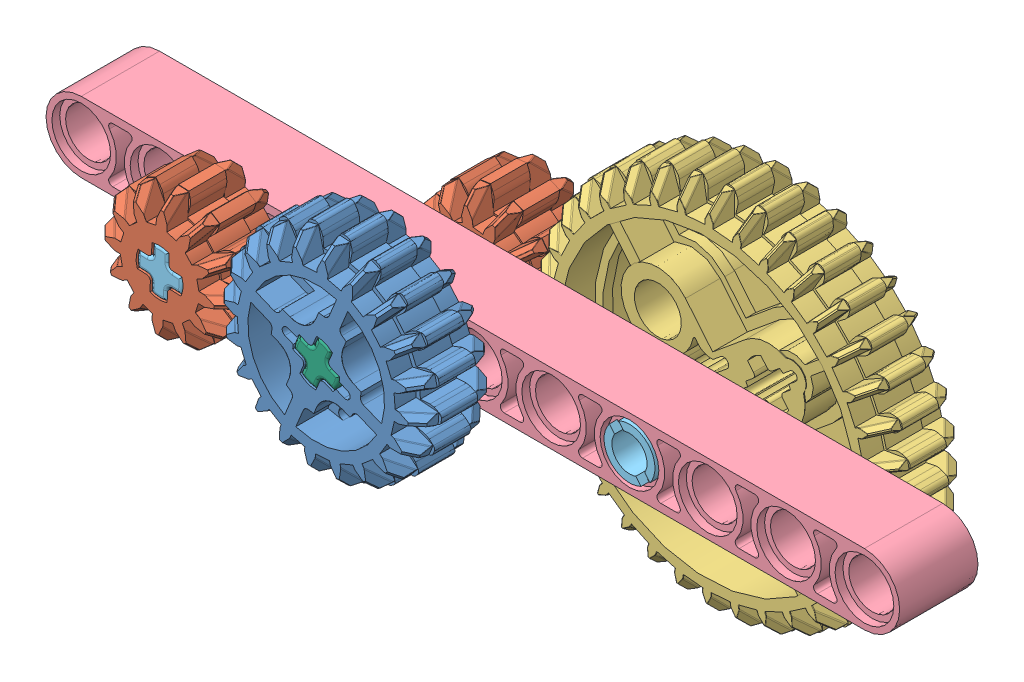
SolidWorks assembly Assem3.sldasm, configuration Default (file format 12000). Lengths in mm.
Overall size (87.2 52.74 24.15).
8 component instances, 6 part files, 20 mates.
Components (placement in the parent):
- 32269 Gear 20 Tooth Double Bevel Gray-1: 32269 Gear 20 Tooth Double Bevel Gray.SLDPRT [Default] at (26.8924 -14.08 30.8196) x (-0.381377 -0.92442 0) z (-0.92442 0.381377 0) size (21.33 8.11 21.33)
- 32270 Gear 12 Tooth Double Bevel-1: 32270 Gear 12 Tooth Double Bevel.SLDPRT [Default] at (10.8924 -14.08 30.8196) x (0.048147 0.99884 0) z (0.99884 -0.048147 0) size (13.27 8.11 13.27)
- 32498 Gear 36 double bevel-1: 32498 Gear 36 double bevel.SLDPRT [Default] at (50.8924 -14.08 14.7871) x (-0.637478 0.770468 0) z (-0.770468 -0.637478 0) size (37.46 8.13 37.46)
- 32525 Beam 11 Yellow-1: 32525 Beam 11 Yellow.SLDPRT [Default] at (-5.1076 -14.08 18.8196) x (1 0 0) z (0 -1 0) size (87.2 8 7.2)
- 3749 Axle Pin without Friction Ridges Lengthwise-1: 3749 Axle Pin without Friction Ridges Lengthwise.SLDPRT [Default] at (10.8924 -14.08 26.8196) x (0.048147 0.99884 0) z (0.99884 -0.048147 0) size (6 16 6)
- 4519 Axle 3-1: 4519 Axle 3.SLDPRT [Default] at (26.8924 -14.08 10.8196) x (0.381377 0.92442 0) z (0.92442 -0.381377 0) size (4.8 24 4.8)
- 3749 Axle Pin without Friction Ridges Lengthwise-2: 3749 Axle Pin without Friction Ridges Lengthwise.SLDPRT [Default] at (50.8924 -14.08 18.8196) x (-0.637478 0.770468 0) z (-0.770468 -0.637478 0) size (6 16 6)
- 32270 Gear 12 Tooth Double Bevel-2: 32270 Gear 12 Tooth Double Bevel.SLDPRT [Default] at (26.8924 -14.08 14.8196) x (0.92442 -0.381377 0) z (-0.381377 -0.92442 0) size (13.27 8.11 13.27)
Mates (geometry in assembly coordinates):
- Concentric2: concentric aligned: cylinder of 32525 Beam 11 Yellow-1 through (50.8924 -14.08 26.8196) axis (0 0 -1) radius 2.4; cylinder of 3749 Axle Pin without Friction Ridges Lengthwise-2 through (50.8924 -14.08 26.8196) axis (0 0 -1) radius 2.4
- Concentric3: concentric anti-aligned: cylinder of 32269 Gear 20 Tooth Double Bevel Gray-1 through (26.8924 -14.08 26.7647) axis (0 0 1) radius 2.4; cylinder of 4519 Axle 3-1 through (26.8924 -14.08 34.8196) axis (0 0 -1) radius 2.4
- Coincident1: coincident anti-aligned: plane of 32269 Gear 20 Tooth Double Bevel Gray-1 through (29.2022 -13.4282 26.7647) normal (-0.100229 -0.994964 0); plane of 4519 Axle 3-1 through (24.759 -12.9806 34.8196) normal (0.100229 0.994964 0)
- Coincident2: coincident aligned: plane of 32269 Gear 20 Tooth Double Bevel Gray-1 through (26.8924 -14.08 34.8196) normal (0 0 1); plane of 4519 Axle 3-1 through (26.8924 -14.08 34.8196) normal (0 0 1)
- Concentric5: concentric anti-aligned: cylinder of 4519 Axle 3-1 through (26.8924 -14.08 34.8196) axis (0 0 -1) radius 2.4; cylinder of 32270 Gear 12 Tooth Double Bevel-2 through (26.8924 -14.08 10.7621) axis (0 0 1) radius 2.4
- Concentric8: concentric anti-aligned: cylinder of 32525 Beam 11 Yellow-1 through (10.8924 -14.08 26.8196) axis (0 0 -1) radius 2.4; cylinder of 3749 Axle Pin without Friction Ridges Lengthwise-1 through (10.8924 -14.08 18.8196) axis (0 0 1) radius 2.4
- Coincident13: coincident anti-aligned: plane of 32525 Beam 11 Yellow-1 through (10.8924 -14.08 26.0196) normal (0 0 1); plane of 3749 Axle Pin without Friction Ridges Lengthwise-1 through (10.8924 -14.08 26.0196) normal (0 0 -1)
- Coincident14: coincident anti-aligned: plane of 32525 Beam 11 Yellow-1 through (50.8924 -14.08 19.6196) normal (0 0 -1); plane of 3749 Axle Pin without Friction Ridges Lengthwise-2 through (50.8924 -14.08 19.6196) normal (0 0 1)
- Concentric9: concentric anti-aligned: cylinder of 32270 Gear 12 Tooth Double Bevel-1 through (10.8924 -14.08 26.7621) axis (0 0 1) radius 2.4; cylinder of 3749 Axle Pin without Friction Ridges Lengthwise-1 through (10.8924 -14.08 34.8196) axis (0 0 -1) radius 2.4
- Coincident15: coincident anti-aligned: plane of 32270 Gear 12 Tooth Double Bevel-1 through (10.8495 -15.6327 26.7621) normal (-0.808062 0.589098 0); plane of 3749 Axle Pin without Friction Ridges Lengthwise-1 through (10.2881 -16.4026 34.8196) normal (0.808062 -0.589098 0)
- Coincident16: coincident anti-aligned: plane of 32270 Gear 12 Tooth Double Bevel-1 through (10.8924 -14.08 26.8196) normal (0 0 -1); plane of 32525 Beam 11 Yellow-1 through (-5.1076 -14.08 26.8196) normal (0 0 1)
- Concentric10: concentric anti-aligned: cylinder of 32498 Gear 36 double bevel-1 through (50.8924 -14.08 27.6736) axis (0 0 -1) radius 2.4; cylinder of 3749 Axle Pin without Friction Ridges Lengthwise-2 through (50.8924 -14.08 10.8196) axis (0 0 1) radius 2.4
- Coincident17: coincident anti-aligned: plane of 32498 Gear 36 double bevel-1 through (51.9429 -12.9357 27.6736) normal (0.223886 -0.974615 0); plane of 3749 Axle Pin without Friction Ridges Lengthwise-2 through (51.9429 -12.9357 10.8196) normal (-0.223886 0.974615 0)
- Coincident18: coincident anti-aligned: plane of 32498 Gear 36 double bevel-1 through (36.0083 -4.0813 18.8196) normal (0 0 1); plane of 32525 Beam 11 Yellow-1 through (-5.1076 -14.08 18.8196) normal (0 0 -1)
- Concentric11: concentric aligned: cylinder of 32525 Beam 11 Yellow-1 through (26.8924 -14.08 26.8196) axis (0 0 -1) radius 2.4; cylinder of 4519 Axle 3-1 through (26.8924 -14.08 34.8196) axis (0 0 -1) radius 2.4
- Coincident19: coincident anti-aligned: plane of 32525 Beam 11 Yellow-1 through (-5.1076 -14.08 18.8196) normal (0 0 -1); plane of 32270 Gear 12 Tooth Double Bevel-2 through (26.8924 -14.08 18.8196) normal (0 0 1)
- Coincident20: coincident anti-aligned: plane of 32269 Gear 20 Tooth Double Bevel Gray-1 through (26.8924 -14.08 26.8196) normal (0 0 -1); plane of 32525 Beam 11 Yellow-1 through (-5.1076 -14.08 26.8196) normal (0 0 1)
- GearMate2: gear = 16.13 mm: circle of 32270 Gear 12 Tooth Double Bevel-1; circle of 32269 Gear 20 Tooth Double Bevel Gray-1
- GearMate3: gear = 32.26 mm: circle of 32270 Gear 12 Tooth Double Bevel-2; circle of 32498 Gear 36 double bevel-1
- Coincident21: coincident anti-aligned: plane of 4519 Axle 3-1 through (27.8562 -13.2926 34.8196) normal (0.100229 0.994964 0); plane of 32270 Gear 12 Tooth Double Bevel-2 through (24.759 -12.9806 10.7621) normal (-0.100229 -0.994964 0)
